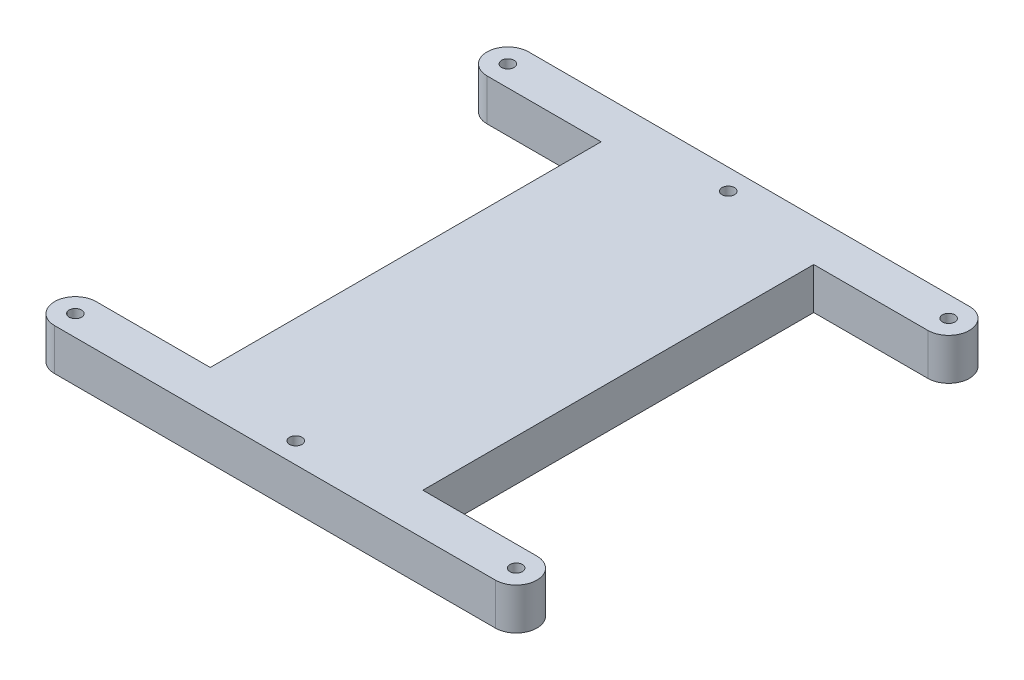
from build123d import *

# Parameters (mm, degrees)
SKIZZE2_R                         = 15
AUFSATZ_LINEAR_AUSTRAGEN1_DEPTH   = 100
AUFSATZ_LINEAR_AUSTRAGEN1_2_DEPTH = 100
SKIZZE4_W                         = 511.21601786
SKIZZE4_H                         = 967.303202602
AUFSATZ_LINEAR_AUSTRAGEN2_DEPTH   = 100


with BuildPart() as part:
    # Skizze2 → Aufsatz-Linear austragen1 (new body)
    with BuildSketch(Plane(origin=(0, -200, 0), x_dir=(1, 0, 0), z_dir=(0, 1, 0))):
        with BuildLine():
            Line((530, -200), (-530, -200))
            ThreePointArc((-530, -200), (-580, -150), (-530, -100))
            Line((-530, -100), (530, -100))
            ThreePointArc((530, -100), (580, -150), (530, -200))
        make_face()
        with Locations(Location((530, -150, 0), (0, 0, 270))):
            Circle(SKIZZE2_R, mode=Mode.SUBTRACT)
        with Locations(Location((-530, -150, 0), (0, 0, 270))):
            Circle(SKIZZE2_R, mode=Mode.SUBTRACT)
        with Locations(Location((0, -150, 0), (0, 0, 270))):
            Circle(SKIZZE2_R, mode=Mode.SUBTRACT)
    extrude(amount=-AUFSATZ_LINEAR_AUSTRAGEN1_DEPTH)



with BuildPart() as body_2:
    # Skizze2 → Aufsatz-Linear austragen1 2 (new body)
    with BuildSketch(Plane(origin=(0, -200, 0), x_dir=(1, 0, 0), z_dir=(0, 1, 0))):
        with BuildLine():
            Line((530, -1140), (-530, -1140))
            ThreePointArc((-530, -1140), (-580, -1190), (-530, -1240))
            Line((-530, -1240), (530, -1240))
            ThreePointArc((530, -1240), (580, -1190), (530, -1140))
        make_face()
        with Locations(Location((-530, -1190, 0), (0, 0, 90))):
            Circle(SKIZZE2_R, mode=Mode.SUBTRACT)
        with Locations(Location((530, -1190, 0), (0, 0, 90))):
            Circle(SKIZZE2_R, mode=Mode.SUBTRACT)
        with Locations(Location((0, -1190, 0), (0, 0, 270))):
            Circle(SKIZZE2_R, mode=Mode.SUBTRACT)
    extrude(amount=-AUFSATZ_LINEAR_AUSTRAGEN1_2_DEPTH)


with BuildPart() as part_1:
    add(part.part)

    add(body_2.part)  # Aufsatz-Linear austragen2 merges body 2
    # Skizze4 → Aufsatz-Linear austragen2 (add)
    with BuildSketch(Plane(origin=(0, -200, 0), x_dir=(1, 0, 0), z_dir=(0, 1, 0))):
        with Locations((0, -670)):
            Rectangle(SKIZZE4_W, SKIZZE4_H)
    extrude(amount=-AUFSATZ_LINEAR_AUSTRAGEN2_DEPTH)


solid = part_1.part
